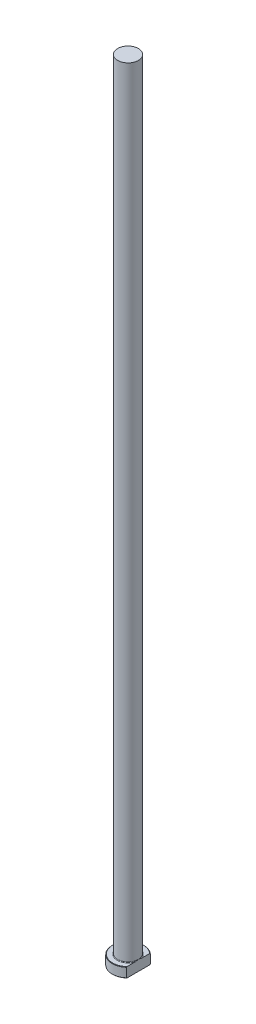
from build123d import *
from build123d.topology import SkipClean

# Parameters (mm, degrees)
CHAMFER1_SIZE = 0.2
FILLET1_R     = 0.3
KEY_DEPTH     = 401.159968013


with BuildPart() as part:
    # Sketch1 → Revolve1 (revolve)
    with BuildSketch(Plane.XY, mode=Mode.PRIVATE) as revolve1_sk:
        Polygon((0, 0), (-8, 0), (-8, 5), (-5.25, 5), (-5.25, 400), (0, 400), align=None)
    revolve(revolve1_sk.sketch.rotate(Axis((0, 259.958771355, 0), (0, -1, 0)), 270), axis=Axis((0, 259.958771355, 0), (0, -1, 0)))

    # Chamfer1
    chamfer1_edges = [part.edges().sort_by_distance(p)[0] for p in [
        (0, 5, -8),
        (0, 0, -8),
    ]]
    chamfer(chamfer1_edges, length=CHAMFER1_SIZE)

    # Fillet1
    fillet1_edges = [part.edges().sort_by_distance(p)[0] for p in [
        (0, 5, -5.25),
    ]]
    fillet(fillet1_edges, radius=FILLET1_R)

    # Sketch2 → KEY (cut, through all)
    with SkipClean():  # the faces are left unmerged after this step: merging them gives an invalid solid
        with BuildSketch(Plane(origin=(0, 0, 0), x_dir=(1, 0, 0), z_dir=(0, 1, 0))):
            with BuildLine():
                Line((5.25, 6.036348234), (5.25, -6.036348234))
                ThreePointArc((5.25, -6.036348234), (8, 0), (5.25, 6.036348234))
            make_face()
        extrude(amount=KEY_DEPTH, mode=Mode.SUBTRACT)


solid = part.part
